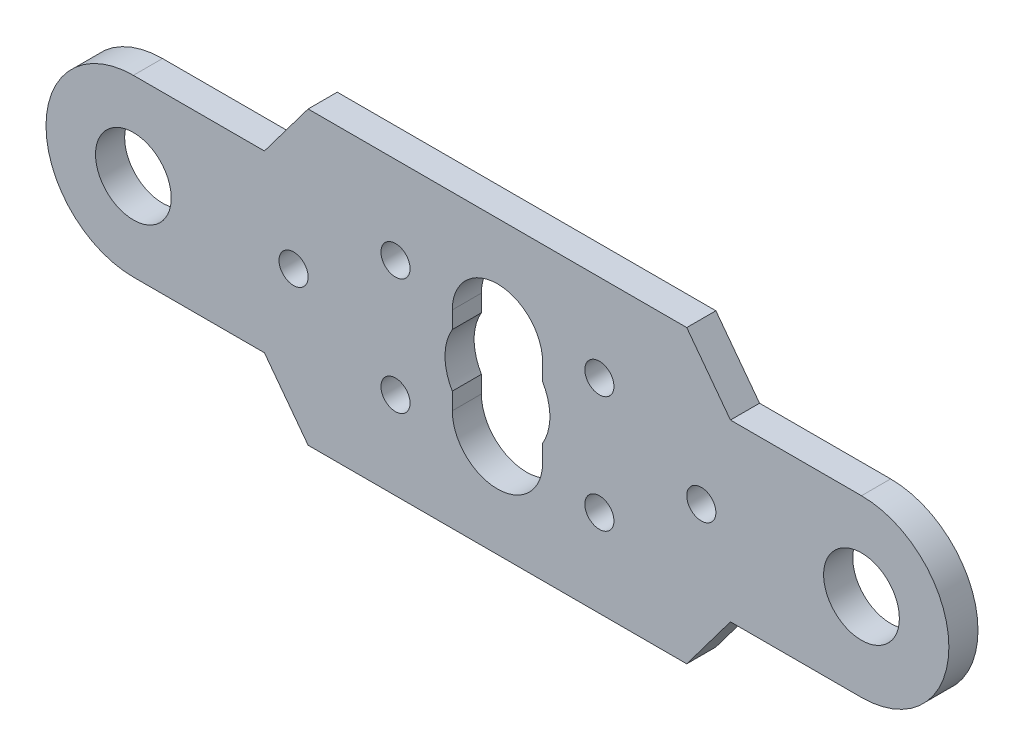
ISO-10303-21;
HEADER;
FILE_DESCRIPTION(('STEP AP214'),'2;1');
FILE_NAME('part.step','',(''),(''),'','','');
FILE_SCHEMA(('AUTOMOTIVE_DESIGN { 1 0 10303 214 1 1 1 1 }'));
ENDSEC;
DATA;
#1=APPLICATION_CONTEXT('core data for automotive mechanical design processes');
#2=APPLICATION_PROTOCOL_DEFINITION('international standard','automotive_design',2000,#1);
#3=PRODUCT_CONTEXT('',#1,'mechanical');
#4=PRODUCT('Part','Part','',(#3));
#5=PRODUCT_RELATED_PRODUCT_CATEGORY('part','',(#4));
#6=PRODUCT_DEFINITION_FORMATION('','',#4);
#7=PRODUCT_DEFINITION_CONTEXT('part definition',#1,'design');
#8=PRODUCT_DEFINITION('design','',#6,#7);
#9=PRODUCT_DEFINITION_SHAPE('','',#8);
#10=(LENGTH_UNIT() NAMED_UNIT(*) SI_UNIT(.MILLI.,.METRE.));
#11=(NAMED_UNIT(*) PLANE_ANGLE_UNIT() SI_UNIT($,.RADIAN.));
#12=(NAMED_UNIT(*) SI_UNIT($,.STERADIAN.) SOLID_ANGLE_UNIT());
#13=UNCERTAINTY_MEASURE_WITH_UNIT(LENGTH_MEASURE(1.E-05),#10,'distance_accuracy_value','');
#14=(GEOMETRIC_REPRESENTATION_CONTEXT(3) GLOBAL_UNCERTAINTY_ASSIGNED_CONTEXT((#13)) GLOBAL_UNIT_ASSIGNED_CONTEXT((#10,
#11,#12)) REPRESENTATION_CONTEXT('',''));
#15=CARTESIAN_POINT('',(0.,0.,0.));
#16=DIRECTION('',(0.,0.,1.));
#17=DIRECTION('',(1.,0.,0.));
#18=AXIS2_PLACEMENT_3D('',#15,#16,#17);
#19=CARTESIAN_POINT('',(12.5,0.,1.));
#20=DIRECTION('',(0.,0.,-1.));
#21=DIRECTION('',(-1.,0.,0.));
#22=AXIS2_PLACEMENT_3D('',#19,#20,#21);
#23=CYLINDRICAL_SURFACE('',#22,3.);
#24=CARTESIAN_POINT('',(12.5,0.,0.));
#25=DIRECTION('',(0.,0.,1.));
#26=DIRECTION('',(-1.,0.,0.));
#27=AXIS2_PLACEMENT_3D('',#24,#25,#26);
#28=CIRCLE('',#27,3.);
#29=CARTESIAN_POINT('',(12.5,-3.,0.));
#30=VERTEX_POINT('',#29);
#31=CARTESIAN_POINT('',(12.5,3.,0.));
#32=VERTEX_POINT('',#31);
#33=EDGE_CURVE('E364',#30,#32,#28,.T.);
#34=ORIENTED_EDGE('',*,*,#33,.T.);
#35=DIRECTION('',(0.,0.,-1.));
#36=VECTOR('',#35,1.);
#37=CARTESIAN_POINT('',(12.5,3.,1.));
#38=LINE('',#37,#36);
#39=CARTESIAN_POINT('',(12.5,3.,1.));
#40=VERTEX_POINT('',#39);
#41=EDGE_CURVE('E39',#40,#32,#38,.T.);
#42=ORIENTED_EDGE('',*,*,#41,.F.);
#43=CARTESIAN_POINT('',(12.5,0.,1.));
#44=DIRECTION('',(0.,0.,1.));
#45=DIRECTION('',(-1.,0.,0.));
#46=AXIS2_PLACEMENT_3D('',#43,#44,#45);
#47=CIRCLE('',#46,3.);
#48=CARTESIAN_POINT('',(12.5,-3.,1.));
#49=VERTEX_POINT('',#48);
#50=EDGE_CURVE('E77',#49,#40,#47,.T.);
#51=ORIENTED_EDGE('',*,*,#50,.F.);
#52=DIRECTION('',(0.,0.,-1.));
#53=VECTOR('',#52,1.);
#54=CARTESIAN_POINT('',(12.5,-3.,1.));
#55=LINE('',#54,#53);
#56=EDGE_CURVE('E329',#49,#30,#55,.T.);
#57=ORIENTED_EDGE('',*,*,#56,.T.);
#58=EDGE_LOOP('',(#34,#42,#51,#57));
#59=FACE_BOUND('',#58,.T.);
#60=ADVANCED_FACE('F32',(#59),#23,.T.);
#61=CARTESIAN_POINT('',(8.00000000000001,3.,1.));
#62=DIRECTION('',(0.,-1.,0.));
#63=DIRECTION('',(0.,0.,-1.));
#64=AXIS2_PLACEMENT_3D('',#61,#62,#63);
#65=PLANE('',#64);
#66=DIRECTION('',(-1.,0.,0.));
#67=VECTOR('',#66,1.);
#68=CARTESIAN_POINT('',(8.00000000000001,3.,0.));
#69=LINE('',#68,#67);
#70=CARTESIAN_POINT('',(8.00000000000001,3.,0.));
#71=VERTEX_POINT('',#70);
#72=EDGE_CURVE('E376',#32,#71,#69,.T.);
#73=ORIENTED_EDGE('',*,*,#72,.T.);
#74=DIRECTION('',(0.,0.,-1.));
#75=VECTOR('',#74,1.);
#76=CARTESIAN_POINT('',(8.00000000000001,3.,1.));
#77=LINE('',#76,#75);
#78=CARTESIAN_POINT('',(8.00000000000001,3.,1.));
#79=VERTEX_POINT('',#78);
#80=EDGE_CURVE('E381',#79,#71,#77,.T.);
#81=ORIENTED_EDGE('',*,*,#80,.F.);
#82=DIRECTION('',(-1.,0.,0.));
#83=VECTOR('',#82,1.);
#84=CARTESIAN_POINT('',(8.00000000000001,3.,1.));
#85=LINE('',#84,#83);
#86=EDGE_CURVE('E368',#40,#79,#85,.T.);
#87=ORIENTED_EDGE('',*,*,#86,.F.);
#88=ORIENTED_EDGE('',*,*,#41,.T.);
#89=EDGE_LOOP('',(#73,#81,#87,#88));
#90=FACE_BOUND('',#89,.T.);
#91=ADVANCED_FACE('F386',(#90),#65,.F.);
#92=CARTESIAN_POINT('',(6.5,5.,1.));
#93=DIRECTION('',(-0.799999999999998,-0.600000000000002,0.));
#94=DIRECTION('',(0.600000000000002,-0.799999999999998,0.));
#95=AXIS2_PLACEMENT_3D('',#92,#93,#94);
#96=PLANE('',#95);
#97=DIRECTION('',(-0.600000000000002,0.799999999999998,0.));
#98=VECTOR('',#97,1.);
#99=CARTESIAN_POINT('',(6.5,5.,0.));
#100=LINE('',#99,#98);
#101=CARTESIAN_POINT('',(6.5,5.,0.));
#102=VERTEX_POINT('',#101);
#103=EDGE_CURVE('E72',#71,#102,#100,.T.);
#104=ORIENTED_EDGE('',*,*,#103,.T.);
#105=DIRECTION('',(0.,0.,-1.));
#106=VECTOR('',#105,1.);
#107=CARTESIAN_POINT('',(6.5,5.,1.));
#108=LINE('',#107,#106);
#109=CARTESIAN_POINT('',(6.5,5.,1.));
#110=VERTEX_POINT('',#109);
#111=EDGE_CURVE('E374',#110,#102,#108,.T.);
#112=ORIENTED_EDGE('',*,*,#111,.F.);
#113=DIRECTION('',(-0.600000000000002,0.799999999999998,0.));
#114=VECTOR('',#113,1.);
#115=CARTESIAN_POINT('',(6.5,5.,1.));
#116=LINE('',#115,#114);
#117=EDGE_CURVE('E55',#79,#110,#116,.T.);
#118=ORIENTED_EDGE('',*,*,#117,.F.);
#119=ORIENTED_EDGE('',*,*,#80,.T.);
#120=EDGE_LOOP('',(#104,#112,#118,#119));
#121=FACE_BOUND('',#120,.T.);
#122=ADVANCED_FACE('F430',(#121),#96,.F.);
#123=CARTESIAN_POINT('',(0.,5.,1.));
#124=DIRECTION('',(0.,-1.,0.));
#125=DIRECTION('',(0.,0.,-1.));
#126=AXIS2_PLACEMENT_3D('',#123,#124,#125);
#127=PLANE('',#126);
#128=DIRECTION('',(-1.,0.,0.));
#129=VECTOR('',#128,1.);
#130=CARTESIAN_POINT('',(0.,5.,0.));
#131=LINE('',#130,#129);
#132=CARTESIAN_POINT('',(-6.5,5.,0.));
#133=VERTEX_POINT('',#132);
#134=EDGE_CURVE('E369',#102,#133,#131,.T.);
#135=ORIENTED_EDGE('',*,*,#134,.T.);
#136=DIRECTION('',(0.,0.,-1.));
#137=VECTOR('',#136,1.);
#138=CARTESIAN_POINT('',(-6.5,5.,1.));
#139=LINE('',#138,#137);
#140=CARTESIAN_POINT('',(-6.5,5.,1.));
#141=VERTEX_POINT('',#140);
#142=EDGE_CURVE('E272',#141,#133,#139,.T.);
#143=ORIENTED_EDGE('',*,*,#142,.F.);
#144=DIRECTION('',(-1.,0.,0.));
#145=VECTOR('',#144,1.);
#146=CARTESIAN_POINT('',(0.,5.,1.));
#147=LINE('',#146,#145);
#148=EDGE_CURVE('E372',#110,#141,#147,.T.);
#149=ORIENTED_EDGE('',*,*,#148,.F.);
#150=ORIENTED_EDGE('',*,*,#111,.T.);
#151=EDGE_LOOP('',(#135,#143,#149,#150));
#152=FACE_BOUND('',#151,.T.);
#153=ADVANCED_FACE('F395',(#152),#127,.F.);
#154=CARTESIAN_POINT('',(12.5,0.,1.));
#155=DIRECTION('',(0.,0.,-1.));
#156=DIRECTION('',(-1.,0.,0.));
#157=AXIS2_PLACEMENT_3D('',#154,#155,#156);
#158=PLANE('',#157);
#159=DIRECTION('',(0.,1.,0.));
#160=VECTOR('',#159,1.);
#161=CARTESIAN_POINT('',(-1.55,1.5,1.));
#162=LINE('',#161,#160);
#163=CARTESIAN_POINT('',(-1.55,0.915150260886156,1.));
#164=VERTEX_POINT('',#163);
#165=CARTESIAN_POINT('',(-1.55,1.5,1.));
#166=VERTEX_POINT('',#165);
#167=EDGE_CURVE('E241',#164,#166,#162,.T.);
#168=ORIENTED_EDGE('',*,*,#167,.T.);
#169=CARTESIAN_POINT('',(0.,1.5,1.));
#170=DIRECTION('',(0.,0.,1.));
#171=DIRECTION('',(1.,0.,0.));
#172=AXIS2_PLACEMENT_3D('',#169,#170,#171);
#173=CIRCLE('',#172,1.55);
#174=CARTESIAN_POINT('',(1.55,1.5,1.));
#175=VERTEX_POINT('',#174);
#176=EDGE_CURVE('E342',#175,#166,#173,.T.);
#177=ORIENTED_EDGE('',*,*,#176,.F.);
#178=DIRECTION('',(0.,1.,0.));
#179=VECTOR('',#178,1.);
#180=CARTESIAN_POINT('',(1.55,1.5,1.));
#181=LINE('',#180,#179);
#182=CARTESIAN_POINT('',(1.55,0.915150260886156,1.));
#183=VERTEX_POINT('',#182);
#184=EDGE_CURVE('E346',#183,#175,#181,.T.);
#185=ORIENTED_EDGE('',*,*,#184,.F.);
#186=CARTESIAN_POINT('',(0.,0.,1.));
#187=DIRECTION('',(0.,0.,1.));
#188=DIRECTION('',(1.,0.,0.));
#189=AXIS2_PLACEMENT_3D('',#186,#187,#188);
#190=CIRCLE('',#189,1.8);
#191=CARTESIAN_POINT('',(1.55,-0.915150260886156,1.));
#192=VERTEX_POINT('',#191);
#193=EDGE_CURVE('E336',#192,#183,#190,.T.);
#194=ORIENTED_EDGE('',*,*,#193,.F.);
#195=DIRECTION('',(0.,-1.,0.));
#196=VECTOR('',#195,1.);
#197=CARTESIAN_POINT('',(1.55,-1.5,1.));
#198=LINE('',#197,#196);
#199=CARTESIAN_POINT('',(1.55,-1.5,1.));
#200=VERTEX_POINT('',#199);
#201=EDGE_CURVE('E196',#192,#200,#198,.T.);
#202=ORIENTED_EDGE('',*,*,#201,.T.);
#203=CARTESIAN_POINT('',(0.,-1.5,1.));
#204=DIRECTION('',(0.,0.,-1.));
#205=DIRECTION('',(1.,0.,0.));
#206=AXIS2_PLACEMENT_3D('',#203,#204,#205);
#207=CIRCLE('',#206,1.55);
#208=CARTESIAN_POINT('',(-1.55,-1.5,1.));
#209=VERTEX_POINT('',#208);
#210=EDGE_CURVE('E291',#200,#209,#207,.T.);
#211=ORIENTED_EDGE('',*,*,#210,.T.);
#212=DIRECTION('',(0.,-1.,0.));
#213=VECTOR('',#212,1.);
#214=CARTESIAN_POINT('',(-1.55,-1.5,1.));
#215=LINE('',#214,#213);
#216=CARTESIAN_POINT('',(-1.55,-0.915150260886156,1.));
#217=VERTEX_POINT('',#216);
#218=EDGE_CURVE('E202',#217,#209,#215,.T.);
#219=ORIENTED_EDGE('',*,*,#218,.F.);
#220=CARTESIAN_POINT('',(0.,0.,1.));
#221=DIRECTION('',(0.,0.,-1.));
#222=DIRECTION('',(-1.,0.,0.));
#223=AXIS2_PLACEMENT_3D('',#220,#221,#222);
#224=CIRCLE('',#223,1.8);
#225=EDGE_CURVE('E181',#217,#164,#224,.T.);
#226=ORIENTED_EDGE('',*,*,#225,.T.);
#227=EDGE_LOOP('',(#168,#177,#185,#194,#202,#211,#219,#226));
#228=FACE_BOUND('',#227,.T.);
#229=CARTESIAN_POINT('',(7.,0.,1.));
#230=DIRECTION('',(0.,0.,1.));
#231=DIRECTION('',(1.,0.,0.));
#232=AXIS2_PLACEMENT_3D('',#229,#230,#231);
#233=CIRCLE('',#232,0.5);
#234=CARTESIAN_POINT('',(7.5,0.,1.));
#235=VERTEX_POINT('',#234);
#236=EDGE_CURVE('E332',#235,#235,#233,.T.);
#237=ORIENTED_EDGE('',*,*,#236,.F.);
#238=EDGE_LOOP('',(#237));
#239=FACE_BOUND('',#238,.T.);
#240=CARTESIAN_POINT('',(12.5,0.,1.));
#241=DIRECTION('',(0.,0.,1.));
#242=DIRECTION('',(1.,0.,0.));
#243=AXIS2_PLACEMENT_3D('',#240,#241,#242);
#244=CIRCLE('',#243,1.3);
#245=CARTESIAN_POINT('',(13.8,0.,1.));
#246=VERTEX_POINT('',#245);
#247=EDGE_CURVE('E358',#246,#246,#244,.T.);
#248=ORIENTED_EDGE('',*,*,#247,.F.);
#249=EDGE_LOOP('',(#248));
#250=FACE_BOUND('',#249,.T.);
#251=CARTESIAN_POINT('',(3.5,2.,1.));
#252=DIRECTION('',(0.,0.,1.));
#253=DIRECTION('',(1.,0.,0.));
#254=AXIS2_PLACEMENT_3D('',#251,#252,#253);
#255=CIRCLE('',#254,0.5);
#256=CARTESIAN_POINT('',(4.,2.,1.));
#257=VERTEX_POINT('',#256);
#258=EDGE_CURVE('E352',#257,#257,#255,.T.);
#259=ORIENTED_EDGE('',*,*,#258,.F.);
#260=EDGE_LOOP('',(#259));
#261=FACE_BOUND('',#260,.T.);
#262=ORIENTED_EDGE('',*,*,#148,.T.);
#263=DIRECTION('',(0.600000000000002,0.799999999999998,0.));
#264=VECTOR('',#263,1.);
#265=CARTESIAN_POINT('',(-6.5,5.,1.));
#266=LINE('',#265,#264);
#267=CARTESIAN_POINT('',(-8.00000000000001,3.,1.));
#268=VERTEX_POINT('',#267);
#269=EDGE_CURVE('E269',#268,#141,#266,.T.);
#270=ORIENTED_EDGE('',*,*,#269,.F.);
#271=DIRECTION('',(1.,0.,0.));
#272=VECTOR('',#271,1.);
#273=CARTESIAN_POINT('',(-8.00000000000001,3.,1.));
#274=LINE('',#273,#272);
#275=CARTESIAN_POINT('',(-12.5,3.,1.));
#276=VERTEX_POINT('',#275);
#277=EDGE_CURVE('E265',#276,#268,#274,.T.);
#278=ORIENTED_EDGE('',*,*,#277,.F.);
#279=CARTESIAN_POINT('',(-12.5,0.,1.));
#280=DIRECTION('',(0.,0.,-1.));
#281=DIRECTION('',(1.,0.,0.));
#282=AXIS2_PLACEMENT_3D('',#279,#280,#281);
#283=CIRCLE('',#282,3.);
#284=CARTESIAN_POINT('',(-12.5,-3.,1.));
#285=VERTEX_POINT('',#284);
#286=EDGE_CURVE('E262',#285,#276,#283,.T.);
#287=ORIENTED_EDGE('',*,*,#286,.F.);
#288=DIRECTION('',(1.,0.,0.));
#289=VECTOR('',#288,1.);
#290=CARTESIAN_POINT('',(-8.00000000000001,-3.,1.));
#291=LINE('',#290,#289);
#292=CARTESIAN_POINT('',(-8.00000000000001,-3.,1.));
#293=VERTEX_POINT('',#292);
#294=EDGE_CURVE('E214',#285,#293,#291,.T.);
#295=ORIENTED_EDGE('',*,*,#294,.T.);
#296=DIRECTION('',(0.600000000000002,-0.799999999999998,0.));
#297=VECTOR('',#296,1.);
#298=CARTESIAN_POINT('',(-6.5,-5.,1.));
#299=LINE('',#298,#297);
#300=CARTESIAN_POINT('',(-6.5,-5.,1.));
#301=VERTEX_POINT('',#300);
#302=EDGE_CURVE('E217',#293,#301,#299,.T.);
#303=ORIENTED_EDGE('',*,*,#302,.T.);
#304=DIRECTION('',(-1.,0.,0.));
#305=VECTOR('',#304,1.);
#306=CARTESIAN_POINT('',(0.,-5.,1.));
#307=LINE('',#306,#305);
#308=CARTESIAN_POINT('',(6.5,-5.,1.));
#309=VERTEX_POINT('',#308);
#310=EDGE_CURVE('E315',#309,#301,#307,.T.);
#311=ORIENTED_EDGE('',*,*,#310,.F.);
#312=DIRECTION('',(-0.600000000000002,-0.799999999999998,0.));
#313=VECTOR('',#312,1.);
#314=CARTESIAN_POINT('',(6.5,-5.,1.));
#315=LINE('',#314,#313);
#316=CARTESIAN_POINT('',(8.00000000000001,-3.,1.));
#317=VERTEX_POINT('',#316);
#318=EDGE_CURVE('E311',#317,#309,#315,.T.);
#319=ORIENTED_EDGE('',*,*,#318,.F.);
#320=DIRECTION('',(-1.,0.,0.));
#321=VECTOR('',#320,1.);
#322=CARTESIAN_POINT('',(8.00000000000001,-3.,1.));
#323=LINE('',#322,#321);
#324=EDGE_CURVE('E308',#49,#317,#323,.T.);
#325=ORIENTED_EDGE('',*,*,#324,.F.);
#326=ORIENTED_EDGE('',*,*,#50,.T.);
#327=ORIENTED_EDGE('',*,*,#86,.T.);
#328=ORIENTED_EDGE('',*,*,#117,.T.);
#329=EDGE_LOOP('',(#262,#270,#278,#287,#295,#303,#311,#319,#325,#326,#327,#328));
#330=FACE_BOUND('',#329,.T.);
#331=CARTESIAN_POINT('',(3.5,-2.,1.));
#332=DIRECTION('',(0.,0.,-1.));
#333=DIRECTION('',(1.,0.,0.));
#334=AXIS2_PLACEMENT_3D('',#331,#332,#333);
#335=CIRCLE('',#334,0.5);
#336=CARTESIAN_POINT('',(4.,-2.,1.));
#337=VERTEX_POINT('',#336);
#338=EDGE_CURVE('E299',#337,#337,#335,.T.);
#339=ORIENTED_EDGE('',*,*,#338,.T.);
#340=EDGE_LOOP('',(#339));
#341=FACE_BOUND('',#340,.T.);
#342=CARTESIAN_POINT('',(-7.,0.,1.));
#343=DIRECTION('',(0.,0.,-1.));
#344=DIRECTION('',(-1.,0.,0.));
#345=AXIS2_PLACEMENT_3D('',#342,#343,#344);
#346=CIRCLE('',#345,0.5);
#347=CARTESIAN_POINT('',(-7.5,0.,1.));
#348=VERTEX_POINT('',#347);
#349=EDGE_CURVE('E233',#348,#348,#346,.T.);
#350=ORIENTED_EDGE('',*,*,#349,.T.);
#351=EDGE_LOOP('',(#350));
#352=FACE_BOUND('',#351,.T.);
#353=CARTESIAN_POINT('',(-12.5,0.,1.));
#354=DIRECTION('',(0.,0.,-1.));
#355=DIRECTION('',(-1.,0.,0.));
#356=AXIS2_PLACEMENT_3D('',#353,#354,#355);
#357=CIRCLE('',#356,1.3);
#358=CARTESIAN_POINT('',(-13.8,0.,1.));
#359=VERTEX_POINT('',#358);
#360=EDGE_CURVE('E253',#359,#359,#357,.T.);
#361=ORIENTED_EDGE('',*,*,#360,.T.);
#362=EDGE_LOOP('',(#361));
#363=FACE_BOUND('',#362,.T.);
#364=CARTESIAN_POINT('',(-3.5,2.,1.));
#365=DIRECTION('',(0.,0.,-1.));
#366=DIRECTION('',(-1.,0.,0.));
#367=AXIS2_PLACEMENT_3D('',#364,#365,#366);
#368=CIRCLE('',#367,0.5);
#369=CARTESIAN_POINT('',(-4.,2.,1.));
#370=VERTEX_POINT('',#369);
#371=EDGE_CURVE('E248',#370,#370,#368,.T.);
#372=ORIENTED_EDGE('',*,*,#371,.T.);
#373=EDGE_LOOP('',(#372));
#374=FACE_BOUND('',#373,.T.);
#375=CARTESIAN_POINT('',(-3.5,-2.,1.));
#376=DIRECTION('',(0.,0.,1.));
#377=DIRECTION('',(-1.,0.,0.));
#378=AXIS2_PLACEMENT_3D('',#375,#376,#377);
#379=CIRCLE('',#378,0.5);
#380=CARTESIAN_POINT('',(-4.,-2.,1.));
#381=VERTEX_POINT('',#380);
#382=EDGE_CURVE('E206',#381,#381,#379,.T.);
#383=ORIENTED_EDGE('',*,*,#382,.F.);
#384=EDGE_LOOP('',(#383));
#385=FACE_BOUND('',#384,.T.);
#386=ADVANCED_FACE('F400',(#228,#239,#250,#261,#330,#341,#352,#363,#374,#385),#158,.F.);
#387=CARTESIAN_POINT('',(12.5,0.,0.));
#388=DIRECTION('',(0.,0.,-1.));
#389=DIRECTION('',(-1.,0.,0.));
#390=AXIS2_PLACEMENT_3D('',#387,#388,#389);
#391=PLANE('',#390);
#392=CARTESIAN_POINT('',(0.,1.5,0.));
#393=DIRECTION('',(0.,0.,1.));
#394=DIRECTION('',(1.,0.,0.));
#395=AXIS2_PLACEMENT_3D('',#392,#393,#394);
#396=CIRCLE('',#395,1.55);
#397=CARTESIAN_POINT('',(1.55,1.5,0.));
#398=VERTEX_POINT('',#397);
#399=CARTESIAN_POINT('',(-1.55,1.5,0.));
#400=VERTEX_POINT('',#399);
#401=EDGE_CURVE('E46',#398,#400,#396,.T.);
#402=ORIENTED_EDGE('',*,*,#401,.T.);
#403=DIRECTION('',(0.,1.,0.));
#404=VECTOR('',#403,1.);
#405=CARTESIAN_POINT('',(-1.55,1.5,0.));
#406=LINE('',#405,#404);
#407=CARTESIAN_POINT('',(-1.55,0.915150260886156,0.));
#408=VERTEX_POINT('',#407);
#409=EDGE_CURVE('E195',#408,#400,#406,.T.);
#410=ORIENTED_EDGE('',*,*,#409,.F.);
#411=CARTESIAN_POINT('',(0.,0.,0.));
#412=DIRECTION('',(0.,0.,1.));
#413=DIRECTION('',(1.,0.,0.));
#414=AXIS2_PLACEMENT_3D('',#411,#412,#413);
#415=CIRCLE('',#414,1.8);
#416=CARTESIAN_POINT('',(-1.55,-0.915150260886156,0.));
#417=VERTEX_POINT('',#416);
#418=EDGE_CURVE('E178',#408,#417,#415,.T.);
#419=ORIENTED_EDGE('',*,*,#418,.T.);
#420=DIRECTION('',(0.,-1.,0.));
#421=VECTOR('',#420,1.);
#422=CARTESIAN_POINT('',(-1.55,-1.5,0.));
#423=LINE('',#422,#421);
#424=CARTESIAN_POINT('',(-1.55,-1.5,0.));
#425=VERTEX_POINT('',#424);
#426=EDGE_CURVE('E187',#417,#425,#423,.T.);
#427=ORIENTED_EDGE('',*,*,#426,.T.);
#428=CARTESIAN_POINT('',(0.,-1.5,0.));
#429=DIRECTION('',(0.,0.,-1.));
#430=DIRECTION('',(1.,0.,0.));
#431=AXIS2_PLACEMENT_3D('',#428,#429,#430);
#432=CIRCLE('',#431,1.55);
#433=CARTESIAN_POINT('',(1.55,-1.5,0.));
#434=VERTEX_POINT('',#433);
#435=EDGE_CURVE('E290',#434,#425,#432,.T.);
#436=ORIENTED_EDGE('',*,*,#435,.F.);
#437=DIRECTION('',(0.,-1.,0.));
#438=VECTOR('',#437,1.);
#439=CARTESIAN_POINT('',(1.55,-1.5,0.));
#440=LINE('',#439,#438);
#441=CARTESIAN_POINT('',(1.55,-0.915150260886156,0.));
#442=VERTEX_POINT('',#441);
#443=EDGE_CURVE('E287',#442,#434,#440,.T.);
#444=ORIENTED_EDGE('',*,*,#443,.F.);
#445=CARTESIAN_POINT('',(0.,0.,0.));
#446=DIRECTION('',(0.,0.,-1.));
#447=DIRECTION('',(-1.,0.,0.));
#448=AXIS2_PLACEMENT_3D('',#445,#446,#447);
#449=CIRCLE('',#448,1.8);
#450=CARTESIAN_POINT('',(1.55,0.915150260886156,0.));
#451=VERTEX_POINT('',#450);
#452=EDGE_CURVE('E11',#451,#442,#449,.T.);
#453=ORIENTED_EDGE('',*,*,#452,.F.);
#454=DIRECTION('',(0.,1.,0.));
#455=VECTOR('',#454,1.);
#456=CARTESIAN_POINT('',(1.55,1.5,0.));
#457=LINE('',#456,#455);
#458=EDGE_CURVE('E339',#451,#398,#457,.T.);
#459=ORIENTED_EDGE('',*,*,#458,.T.);
#460=EDGE_LOOP('',(#402,#410,#419,#427,#436,#444,#453,#459));
#461=FACE_BOUND('',#460,.T.);
#462=CARTESIAN_POINT('',(7.,0.,0.));
#463=DIRECTION('',(0.,0.,1.));
#464=DIRECTION('',(1.,0.,0.));
#465=AXIS2_PLACEMENT_3D('',#462,#463,#464);
#466=CIRCLE('',#465,0.5);
#467=CARTESIAN_POINT('',(7.5,0.,0.));
#468=VERTEX_POINT('',#467);
#469=EDGE_CURVE('E333',#468,#468,#466,.T.);
#470=ORIENTED_EDGE('',*,*,#469,.T.);
#471=EDGE_LOOP('',(#470));
#472=FACE_BOUND('',#471,.T.);
#473=CARTESIAN_POINT('',(12.5,0.,0.));
#474=DIRECTION('',(0.,0.,1.));
#475=DIRECTION('',(1.,0.,0.));
#476=AXIS2_PLACEMENT_3D('',#473,#474,#475);
#477=CIRCLE('',#476,1.3);
#478=CARTESIAN_POINT('',(13.8,0.,0.));
#479=VERTEX_POINT('',#478);
#480=EDGE_CURVE('E361',#479,#479,#477,.T.);
#481=ORIENTED_EDGE('',*,*,#480,.T.);
#482=EDGE_LOOP('',(#481));
#483=FACE_BOUND('',#482,.T.);
#484=DIRECTION('',(0.600000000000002,0.799999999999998,0.));
#485=VECTOR('',#484,1.);
#486=CARTESIAN_POINT('',(-6.5,5.,0.));
#487=LINE('',#486,#485);
#488=CARTESIAN_POINT('',(-8.00000000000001,3.,0.));
#489=VERTEX_POINT('',#488);
#490=EDGE_CURVE('E266',#489,#133,#487,.T.);
#491=ORIENTED_EDGE('',*,*,#490,.T.);
#492=ORIENTED_EDGE('',*,*,#134,.F.);
#493=ORIENTED_EDGE('',*,*,#103,.F.);
#494=ORIENTED_EDGE('',*,*,#72,.F.);
#495=ORIENTED_EDGE('',*,*,#33,.F.);
#496=DIRECTION('',(-1.,0.,0.));
#497=VECTOR('',#496,1.);
#498=CARTESIAN_POINT('',(8.00000000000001,-3.,0.));
#499=LINE('',#498,#497);
#500=CARTESIAN_POINT('',(8.00000000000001,-3.,0.));
#501=VERTEX_POINT('',#500);
#502=EDGE_CURVE('E305',#30,#501,#499,.T.);
#503=ORIENTED_EDGE('',*,*,#502,.T.);
#504=DIRECTION('',(-0.600000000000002,-0.799999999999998,0.));
#505=VECTOR('',#504,1.);
#506=CARTESIAN_POINT('',(6.5,-5.,0.));
#507=LINE('',#506,#505);
#508=CARTESIAN_POINT('',(6.5,-5.,0.));
#509=VERTEX_POINT('',#508);
#510=EDGE_CURVE('E320',#501,#509,#507,.T.);
#511=ORIENTED_EDGE('',*,*,#510,.T.);
#512=DIRECTION('',(-1.,0.,0.));
#513=VECTOR('',#512,1.);
#514=CARTESIAN_POINT('',(0.,-5.,0.));
#515=LINE('',#514,#513);
#516=CARTESIAN_POINT('',(-6.5,-5.,0.));
#517=VERTEX_POINT('',#516);
#518=EDGE_CURVE('E312',#509,#517,#515,.T.);
#519=ORIENTED_EDGE('',*,*,#518,.T.);
#520=DIRECTION('',(0.600000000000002,-0.799999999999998,0.));
#521=VECTOR('',#520,1.);
#522=CARTESIAN_POINT('',(-6.5,-5.,0.));
#523=LINE('',#522,#521);
#524=CARTESIAN_POINT('',(-8.00000000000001,-3.,0.));
#525=VERTEX_POINT('',#524);
#526=EDGE_CURVE('E218',#525,#517,#523,.T.);
#527=ORIENTED_EDGE('',*,*,#526,.F.);
#528=DIRECTION('',(1.,0.,0.));
#529=VECTOR('',#528,1.);
#530=CARTESIAN_POINT('',(-8.00000000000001,-3.,0.));
#531=LINE('',#530,#529);
#532=CARTESIAN_POINT('',(-12.5,-3.,0.));
#533=VERTEX_POINT('',#532);
#534=EDGE_CURVE('E211',#533,#525,#531,.T.);
#535=ORIENTED_EDGE('',*,*,#534,.F.);
#536=CARTESIAN_POINT('',(-12.5,0.,0.));
#537=DIRECTION('',(0.,0.,-1.));
#538=DIRECTION('',(1.,0.,0.));
#539=AXIS2_PLACEMENT_3D('',#536,#537,#538);
#540=CIRCLE('',#539,3.);
#541=CARTESIAN_POINT('',(-12.5,3.,0.));
#542=VERTEX_POINT('',#541);
#543=EDGE_CURVE('E259',#533,#542,#540,.T.);
#544=ORIENTED_EDGE('',*,*,#543,.T.);
#545=DIRECTION('',(1.,0.,0.));
#546=VECTOR('',#545,1.);
#547=CARTESIAN_POINT('',(-8.00000000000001,3.,0.));
#548=LINE('',#547,#546);
#549=EDGE_CURVE('E275',#542,#489,#548,.T.);
#550=ORIENTED_EDGE('',*,*,#549,.T.);
#551=EDGE_LOOP('',(#491,#492,#493,#494,#495,#503,#511,#519,#527,#535,#544,#550));
#552=FACE_BOUND('',#551,.T.);
#553=CARTESIAN_POINT('',(3.5,2.,0.));
#554=DIRECTION('',(0.,0.,1.));
#555=DIRECTION('',(1.,0.,0.));
#556=AXIS2_PLACEMENT_3D('',#553,#554,#555);
#557=CIRCLE('',#556,0.5);
#558=CARTESIAN_POINT('',(4.,2.,0.));
#559=VERTEX_POINT('',#558);
#560=EDGE_CURVE('E355',#559,#559,#557,.T.);
#561=ORIENTED_EDGE('',*,*,#560,.T.);
#562=EDGE_LOOP('',(#561));
#563=FACE_BOUND('',#562,.T.);
#564=CARTESIAN_POINT('',(3.5,-2.,0.));
#565=DIRECTION('',(0.,0.,-1.));
#566=DIRECTION('',(1.,0.,0.));
#567=AXIS2_PLACEMENT_3D('',#564,#565,#566);
#568=CIRCLE('',#567,0.5);
#569=CARTESIAN_POINT('',(4.,-2.,0.));
#570=VERTEX_POINT('',#569);
#571=EDGE_CURVE('E302',#570,#570,#568,.T.);
#572=ORIENTED_EDGE('',*,*,#571,.F.);
#573=EDGE_LOOP('',(#572));
#574=FACE_BOUND('',#573,.T.);
#575=CARTESIAN_POINT('',(-7.,0.,0.));
#576=DIRECTION('',(0.,0.,-1.));
#577=DIRECTION('',(-1.,0.,0.));
#578=AXIS2_PLACEMENT_3D('',#575,#576,#577);
#579=CIRCLE('',#578,0.5);
#580=CARTESIAN_POINT('',(-7.5,0.,0.));
#581=VERTEX_POINT('',#580);
#582=EDGE_CURVE('E234',#581,#581,#579,.T.);
#583=ORIENTED_EDGE('',*,*,#582,.F.);
#584=EDGE_LOOP('',(#583));
#585=FACE_BOUND('',#584,.T.);
#586=CARTESIAN_POINT('',(-12.5,0.,0.));
#587=DIRECTION('',(0.,0.,-1.));
#588=DIRECTION('',(-1.,0.,0.));
#589=AXIS2_PLACEMENT_3D('',#586,#587,#588);
#590=CIRCLE('',#589,1.3);
#591=CARTESIAN_POINT('',(-13.8,0.,0.));
#592=VERTEX_POINT('',#591);
#593=EDGE_CURVE('E256',#592,#592,#590,.T.);
#594=ORIENTED_EDGE('',*,*,#593,.F.);
#595=EDGE_LOOP('',(#594));
#596=FACE_BOUND('',#595,.T.);
#597=CARTESIAN_POINT('',(-3.5,2.,0.));
#598=DIRECTION('',(0.,0.,-1.));
#599=DIRECTION('',(-1.,0.,0.));
#600=AXIS2_PLACEMENT_3D('',#597,#598,#599);
#601=CIRCLE('',#600,0.5);
#602=CARTESIAN_POINT('',(-4.,2.,0.));
#603=VERTEX_POINT('',#602);
#604=EDGE_CURVE('E250',#603,#603,#601,.T.);
#605=ORIENTED_EDGE('',*,*,#604,.F.);
#606=EDGE_LOOP('',(#605));
#607=FACE_BOUND('',#606,.T.);
#608=CARTESIAN_POINT('',(-3.5,-2.,0.));
#609=DIRECTION('',(0.,0.,1.));
#610=DIRECTION('',(-1.,0.,0.));
#611=AXIS2_PLACEMENT_3D('',#608,#609,#610);
#612=CIRCLE('',#611,0.5);
#613=CARTESIAN_POINT('',(-4.,-2.,0.));
#614=VERTEX_POINT('',#613);
#615=EDGE_CURVE('E208',#614,#614,#612,.T.);
#616=ORIENTED_EDGE('',*,*,#615,.T.);
#617=EDGE_LOOP('',(#616));
#618=FACE_BOUND('',#617,.T.);
#619=ADVANCED_FACE('F191',(#461,#472,#483,#552,#563,#574,#585,#596,#607,#618),#391,.T.);
#620=CARTESIAN_POINT('',(12.5,0.,0.));
#621=DIRECTION('',(0.,0.,1.));
#622=DIRECTION('',(1.,0.,0.));
#623=AXIS2_PLACEMENT_3D('',#620,#621,#622);
#624=CYLINDRICAL_SURFACE('',#623,1.3);
#625=ORIENTED_EDGE('',*,*,#247,.T.);
#626=EDGE_LOOP('',(#625));
#627=FACE_BOUND('',#626,.T.);
#628=ORIENTED_EDGE('',*,*,#480,.F.);
#629=EDGE_LOOP('',(#628));
#630=FACE_BOUND('',#629,.T.);
#631=ADVANCED_FACE('F440',(#627,#630),#624,.F.);
#632=CARTESIAN_POINT('',(3.5,2.,0.));
#633=DIRECTION('',(0.,0.,1.));
#634=DIRECTION('',(1.,0.,0.));
#635=AXIS2_PLACEMENT_3D('',#632,#633,#634);
#636=CYLINDRICAL_SURFACE('',#635,0.5);
#637=ORIENTED_EDGE('',*,*,#560,.F.);
#638=EDGE_LOOP('',(#637));
#639=FACE_BOUND('',#638,.T.);
#640=ORIENTED_EDGE('',*,*,#258,.T.);
#641=EDGE_LOOP('',(#640));
#642=FACE_BOUND('',#641,.T.);
#643=ADVANCED_FACE('F446',(#639,#642),#636,.F.);
#644=CARTESIAN_POINT('',(0.,0.,0.));
#645=DIRECTION('',(0.,0.,1.));
#646=DIRECTION('',(1.,0.,0.));
#647=AXIS2_PLACEMENT_3D('',#644,#645,#646);
#648=CYLINDRICAL_SURFACE('',#647,1.8);
#649=ORIENTED_EDGE('',*,*,#193,.T.);
#650=DIRECTION('',(0.,0.,1.));
#651=VECTOR('',#650,1.);
#652=CARTESIAN_POINT('',(1.55,0.915150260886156,0.));
#653=LINE('',#652,#651);
#654=EDGE_CURVE('E344',#451,#183,#653,.T.);
#655=ORIENTED_EDGE('',*,*,#654,.F.);
#656=ORIENTED_EDGE('',*,*,#452,.T.);
#657=DIRECTION('',(0.,0.,1.));
#658=VECTOR('',#657,1.);
#659=CARTESIAN_POINT('',(1.55,-0.915150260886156,0.));
#660=LINE('',#659,#658);
#661=EDGE_CURVE('E293',#442,#192,#660,.T.);
#662=ORIENTED_EDGE('',*,*,#661,.T.);
#663=EDGE_LOOP('',(#649,#655,#656,#662));
#664=FACE_BOUND('',#663,.T.);
#665=ADVANCED_FACE('F450',(#664),#648,.F.);
#666=CARTESIAN_POINT('',(0.,1.5,0.));
#667=DIRECTION('',(0.,0.,1.));
#668=DIRECTION('',(1.,0.,0.));
#669=AXIS2_PLACEMENT_3D('',#666,#667,#668);
#670=CYLINDRICAL_SURFACE('',#669,1.55);
#671=ORIENTED_EDGE('',*,*,#401,.F.);
#672=DIRECTION('',(0.,0.,1.));
#673=VECTOR('',#672,1.);
#674=CARTESIAN_POINT('',(1.55,1.5,0.));
#675=LINE('',#674,#673);
#676=EDGE_CURVE('E350',#398,#175,#675,.T.);
#677=ORIENTED_EDGE('',*,*,#676,.T.);
#678=ORIENTED_EDGE('',*,*,#176,.T.);
#679=DIRECTION('',(0.,0.,1.));
#680=VECTOR('',#679,1.);
#681=CARTESIAN_POINT('',(-1.55,1.5,0.));
#682=LINE('',#681,#680);
#683=EDGE_CURVE('E245',#400,#166,#682,.T.);
#684=ORIENTED_EDGE('',*,*,#683,.F.);
#685=EDGE_LOOP('',(#671,#677,#678,#684));
#686=FACE_BOUND('',#685,.T.);
#687=ADVANCED_FACE('F454',(#686),#670,.F.);
#688=CARTESIAN_POINT('',(1.55,1.5,0.));
#689=DIRECTION('',(1.,0.,0.));
#690=DIRECTION('',(0.,1.,0.));
#691=AXIS2_PLACEMENT_3D('',#688,#689,#690);
#692=PLANE('',#691);
#693=ORIENTED_EDGE('',*,*,#184,.T.);
#694=ORIENTED_EDGE('',*,*,#676,.F.);
#695=ORIENTED_EDGE('',*,*,#458,.F.);
#696=ORIENTED_EDGE('',*,*,#654,.T.);
#697=EDGE_LOOP('',(#693,#694,#695,#696));
#698=FACE_BOUND('',#697,.T.);
#699=ADVANCED_FACE('F456',(#698),#692,.F.);
#700=CARTESIAN_POINT('',(7.,0.,0.));
#701=DIRECTION('',(0.,0.,1.));
#702=DIRECTION('',(1.,0.,0.));
#703=AXIS2_PLACEMENT_3D('',#700,#701,#702);
#704=CYLINDRICAL_SURFACE('',#703,0.5);
#705=ORIENTED_EDGE('',*,*,#236,.T.);
#706=EDGE_LOOP('',(#705));
#707=FACE_BOUND('',#706,.T.);
#708=ORIENTED_EDGE('',*,*,#469,.F.);
#709=EDGE_LOOP('',(#708));
#710=FACE_BOUND('',#709,.T.);
#711=ADVANCED_FACE('F459',(#707,#710),#704,.F.);
#712=CARTESIAN_POINT('',(8.00000000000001,-3.,1.));
#713=DIRECTION('',(0.,1.,0.));
#714=DIRECTION('',(0.,0.,-1.));
#715=AXIS2_PLACEMENT_3D('',#712,#713,#714);
#716=PLANE('',#715);
#717=ORIENTED_EDGE('',*,*,#502,.F.);
#718=ORIENTED_EDGE('',*,*,#56,.F.);
#719=ORIENTED_EDGE('',*,*,#324,.T.);
#720=DIRECTION('',(0.,0.,-1.));
#721=VECTOR('',#720,1.);
#722=CARTESIAN_POINT('',(8.00000000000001,-3.,1.));
#723=LINE('',#722,#721);
#724=EDGE_CURVE('E326',#317,#501,#723,.T.);
#725=ORIENTED_EDGE('',*,*,#724,.T.);
#726=EDGE_LOOP('',(#717,#718,#719,#725));
#727=FACE_BOUND('',#726,.T.);
#728=ADVANCED_FACE('F425',(#727),#716,.F.);
#729=CARTESIAN_POINT('',(6.5,-5.,1.));
#730=DIRECTION('',(-0.799999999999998,0.600000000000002,0.));
#731=DIRECTION('',(0.600000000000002,0.799999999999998,0.));
#732=AXIS2_PLACEMENT_3D('',#729,#730,#731);
#733=PLANE('',#732);
#734=ORIENTED_EDGE('',*,*,#510,.F.);
#735=ORIENTED_EDGE('',*,*,#724,.F.);
#736=ORIENTED_EDGE('',*,*,#318,.T.);
#737=DIRECTION('',(0.,0.,-1.));
#738=VECTOR('',#737,1.);
#739=CARTESIAN_POINT('',(6.5,-5.,1.));
#740=LINE('',#739,#738);
#741=EDGE_CURVE('E317',#309,#509,#740,.T.);
#742=ORIENTED_EDGE('',*,*,#741,.T.);
#743=EDGE_LOOP('',(#734,#735,#736,#742));
#744=FACE_BOUND('',#743,.T.);
#745=ADVANCED_FACE('F422',(#744),#733,.F.);
#746=CARTESIAN_POINT('',(0.,-5.,1.));
#747=DIRECTION('',(0.,1.,0.));
#748=DIRECTION('',(0.,0.,-1.));
#749=AXIS2_PLACEMENT_3D('',#746,#747,#748);
#750=PLANE('',#749);
#751=ORIENTED_EDGE('',*,*,#518,.F.);
#752=ORIENTED_EDGE('',*,*,#741,.F.);
#753=ORIENTED_EDGE('',*,*,#310,.T.);
#754=DIRECTION('',(0.,0.,-1.));
#755=VECTOR('',#754,1.);
#756=CARTESIAN_POINT('',(-6.5,-5.,1.));
#757=LINE('',#756,#755);
#758=EDGE_CURVE('E221',#301,#517,#757,.T.);
#759=ORIENTED_EDGE('',*,*,#758,.T.);
#760=EDGE_LOOP('',(#751,#752,#753,#759));
#761=FACE_BOUND('',#760,.T.);
#762=ADVANCED_FACE('F419',(#761),#750,.F.);
#763=CARTESIAN_POINT('',(3.5,-2.,0.));
#764=DIRECTION('',(0.,0.,1.));
#765=DIRECTION('',(1.,0.,0.));
#766=AXIS2_PLACEMENT_3D('',#763,#764,#765);
#767=CYLINDRICAL_SURFACE('',#766,0.5);
#768=ORIENTED_EDGE('',*,*,#571,.T.);
#769=EDGE_LOOP('',(#768));
#770=FACE_BOUND('',#769,.T.);
#771=ORIENTED_EDGE('',*,*,#338,.F.);
#772=EDGE_LOOP('',(#771));
#773=FACE_BOUND('',#772,.T.);
#774=ADVANCED_FACE('F472',(#770,#773),#767,.F.);
#775=CARTESIAN_POINT('',(0.,-1.5,0.));
#776=DIRECTION('',(0.,0.,1.));
#777=DIRECTION('',(1.,0.,0.));
#778=AXIS2_PLACEMENT_3D('',#775,#776,#777);
#779=CYLINDRICAL_SURFACE('',#778,1.55);
#780=ORIENTED_EDGE('',*,*,#435,.T.);
#781=DIRECTION('',(0.,0.,1.));
#782=VECTOR('',#781,1.);
#783=CARTESIAN_POINT('',(-1.55,-1.5,0.));
#784=LINE('',#783,#782);
#785=EDGE_CURVE('E186',#425,#209,#784,.T.);
#786=ORIENTED_EDGE('',*,*,#785,.T.);
#787=ORIENTED_EDGE('',*,*,#210,.F.);
#788=DIRECTION('',(0.,0.,1.));
#789=VECTOR('',#788,1.);
#790=CARTESIAN_POINT('',(1.55,-1.5,0.));
#791=LINE('',#790,#789);
#792=EDGE_CURVE('E297',#434,#200,#791,.T.);
#793=ORIENTED_EDGE('',*,*,#792,.F.);
#794=EDGE_LOOP('',(#780,#786,#787,#793));
#795=FACE_BOUND('',#794,.T.);
#796=ADVANCED_FACE('F475',(#795),#779,.F.);
#797=CARTESIAN_POINT('',(1.55,-1.5,0.));
#798=DIRECTION('',(1.,0.,0.));
#799=DIRECTION('',(0.,-1.,0.));
#800=AXIS2_PLACEMENT_3D('',#797,#798,#799);
#801=PLANE('',#800);
#802=ORIENTED_EDGE('',*,*,#201,.F.);
#803=ORIENTED_EDGE('',*,*,#661,.F.);
#804=ORIENTED_EDGE('',*,*,#443,.T.);
#805=ORIENTED_EDGE('',*,*,#792,.T.);
#806=EDGE_LOOP('',(#802,#803,#804,#805));
#807=FACE_BOUND('',#806,.T.);
#808=ADVANCED_FACE('F477',(#807),#801,.F.);
#809=CARTESIAN_POINT('',(-12.5,0.,1.));
#810=DIRECTION('',(0.,0.,-1.));
#811=DIRECTION('',(1.,0.,0.));
#812=AXIS2_PLACEMENT_3D('',#809,#810,#811);
#813=CYLINDRICAL_SURFACE('',#812,3.);
#814=ORIENTED_EDGE('',*,*,#543,.F.);
#815=DIRECTION('',(0.,0.,-1.));
#816=VECTOR('',#815,1.);
#817=CARTESIAN_POINT('',(-12.5,-3.,1.));
#818=LINE('',#817,#816);
#819=EDGE_CURVE('E230',#285,#533,#818,.T.);
#820=ORIENTED_EDGE('',*,*,#819,.F.);
#821=ORIENTED_EDGE('',*,*,#286,.T.);
#822=DIRECTION('',(0.,0.,-1.));
#823=VECTOR('',#822,1.);
#824=CARTESIAN_POINT('',(-12.5,3.,1.));
#825=LINE('',#824,#823);
#826=EDGE_CURVE('E197',#276,#542,#825,.T.);
#827=ORIENTED_EDGE('',*,*,#826,.T.);
#828=EDGE_LOOP('',(#814,#820,#821,#827));
#829=FACE_BOUND('',#828,.T.);
#830=ADVANCED_FACE('F409',(#829),#813,.T.);
#831=CARTESIAN_POINT('',(-8.00000000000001,3.,1.));
#832=DIRECTION('',(0.,-1.,0.));
#833=DIRECTION('',(0.,0.,-1.));
#834=AXIS2_PLACEMENT_3D('',#831,#832,#833);
#835=PLANE('',#834);
#836=ORIENTED_EDGE('',*,*,#549,.F.);
#837=ORIENTED_EDGE('',*,*,#826,.F.);
#838=ORIENTED_EDGE('',*,*,#277,.T.);
#839=DIRECTION('',(0.,0.,-1.));
#840=VECTOR('',#839,1.);
#841=CARTESIAN_POINT('',(-8.00000000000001,3.,1.));
#842=LINE('',#841,#840);
#843=EDGE_CURVE('E282',#268,#489,#842,.T.);
#844=ORIENTED_EDGE('',*,*,#843,.T.);
#845=EDGE_LOOP('',(#836,#837,#838,#844));
#846=FACE_BOUND('',#845,.T.);
#847=ADVANCED_FACE('F406',(#846),#835,.F.);
#848=CARTESIAN_POINT('',(-6.5,5.,1.));
#849=DIRECTION('',(0.799999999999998,-0.600000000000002,0.));
#850=DIRECTION('',(-0.600000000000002,-0.799999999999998,0.));
#851=AXIS2_PLACEMENT_3D('',#848,#849,#850);
#852=PLANE('',#851);
#853=ORIENTED_EDGE('',*,*,#490,.F.);
#854=ORIENTED_EDGE('',*,*,#843,.F.);
#855=ORIENTED_EDGE('',*,*,#269,.T.);
#856=ORIENTED_EDGE('',*,*,#142,.T.);
#857=EDGE_LOOP('',(#853,#854,#855,#856));
#858=FACE_BOUND('',#857,.T.);
#859=ADVANCED_FACE('F398',(#858),#852,.F.);
#860=CARTESIAN_POINT('',(-12.5,0.,0.));
#861=DIRECTION('',(0.,0.,1.));
#862=DIRECTION('',(-1.,0.,0.));
#863=AXIS2_PLACEMENT_3D('',#860,#861,#862);
#864=CYLINDRICAL_SURFACE('',#863,1.3);
#865=ORIENTED_EDGE('',*,*,#360,.F.);
#866=EDGE_LOOP('',(#865));
#867=FACE_BOUND('',#866,.T.);
#868=ORIENTED_EDGE('',*,*,#593,.T.);
#869=EDGE_LOOP('',(#868));
#870=FACE_BOUND('',#869,.T.);
#871=ADVANCED_FACE('F490',(#867,#870),#864,.F.);
#872=CARTESIAN_POINT('',(-3.5,2.,0.));
#873=DIRECTION('',(0.,0.,1.));
#874=DIRECTION('',(-1.,0.,0.));
#875=AXIS2_PLACEMENT_3D('',#872,#873,#874);
#876=CYLINDRICAL_SURFACE('',#875,0.5);
#877=ORIENTED_EDGE('',*,*,#604,.T.);
#878=EDGE_LOOP('',(#877));
#879=FACE_BOUND('',#878,.T.);
#880=ORIENTED_EDGE('',*,*,#371,.F.);
#881=EDGE_LOOP('',(#880));
#882=FACE_BOUND('',#881,.T.);
#883=ADVANCED_FACE('F493',(#879,#882),#876,.F.);
#884=CARTESIAN_POINT('',(0.,0.,0.));
#885=DIRECTION('',(0.,0.,1.));
#886=DIRECTION('',(-1.,0.,0.));
#887=AXIS2_PLACEMENT_3D('',#884,#885,#886);
#888=CYLINDRICAL_SURFACE('',#887,1.8);
#889=ORIENTED_EDGE('',*,*,#225,.F.);
#890=DIRECTION('',(0.,0.,1.));
#891=VECTOR('',#890,1.);
#892=CARTESIAN_POINT('',(-1.55,-0.915150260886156,0.));
#893=LINE('',#892,#891);
#894=EDGE_CURVE('E175',#417,#217,#893,.T.);
#895=ORIENTED_EDGE('',*,*,#894,.F.);
#896=ORIENTED_EDGE('',*,*,#418,.F.);
#897=DIRECTION('',(0.,0.,1.));
#898=VECTOR('',#897,1.);
#899=CARTESIAN_POINT('',(-1.55,0.915150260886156,0.));
#900=LINE('',#899,#898);
#901=EDGE_CURVE('E240',#408,#164,#900,.T.);
#902=ORIENTED_EDGE('',*,*,#901,.T.);
#903=EDGE_LOOP('',(#889,#895,#896,#902));
#904=FACE_BOUND('',#903,.T.);
#905=ADVANCED_FACE('F177',(#904),#888,.F.);
#906=CARTESIAN_POINT('',(-1.55,1.5,0.));
#907=DIRECTION('',(-1.,0.,0.));
#908=DIRECTION('',(0.,1.,0.));
#909=AXIS2_PLACEMENT_3D('',#906,#907,#908);
#910=PLANE('',#909);
#911=ORIENTED_EDGE('',*,*,#167,.F.);
#912=ORIENTED_EDGE('',*,*,#901,.F.);
#913=ORIENTED_EDGE('',*,*,#409,.T.);
#914=ORIENTED_EDGE('',*,*,#683,.T.);
#915=EDGE_LOOP('',(#911,#912,#913,#914));
#916=FACE_BOUND('',#915,.T.);
#917=ADVANCED_FACE('F500',(#916),#910,.F.);
#918=CARTESIAN_POINT('',(-7.,0.,0.));
#919=DIRECTION('',(0.,0.,1.));
#920=DIRECTION('',(-1.,0.,0.));
#921=AXIS2_PLACEMENT_3D('',#918,#919,#920);
#922=CYLINDRICAL_SURFACE('',#921,0.5);
#923=ORIENTED_EDGE('',*,*,#349,.F.);
#924=EDGE_LOOP('',(#923));
#925=FACE_BOUND('',#924,.T.);
#926=ORIENTED_EDGE('',*,*,#582,.T.);
#927=EDGE_LOOP('',(#926));
#928=FACE_BOUND('',#927,.T.);
#929=ADVANCED_FACE('F503',(#925,#928),#922,.F.);
#930=CARTESIAN_POINT('',(-8.00000000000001,-3.,1.));
#931=DIRECTION('',(0.,1.,0.));
#932=DIRECTION('',(0.,0.,-1.));
#933=AXIS2_PLACEMENT_3D('',#930,#931,#932);
#934=PLANE('',#933);
#935=ORIENTED_EDGE('',*,*,#534,.T.);
#936=DIRECTION('',(0.,0.,-1.));
#937=VECTOR('',#936,1.);
#938=CARTESIAN_POINT('',(-8.00000000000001,-3.,1.));
#939=LINE('',#938,#937);
#940=EDGE_CURVE('E228',#293,#525,#939,.T.);
#941=ORIENTED_EDGE('',*,*,#940,.F.);
#942=ORIENTED_EDGE('',*,*,#294,.F.);
#943=ORIENTED_EDGE('',*,*,#819,.T.);
#944=EDGE_LOOP('',(#935,#941,#942,#943));
#945=FACE_BOUND('',#944,.T.);
#946=ADVANCED_FACE('F411',(#945),#934,.F.);
#947=CARTESIAN_POINT('',(-6.5,-5.,1.));
#948=DIRECTION('',(0.799999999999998,0.600000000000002,0.));
#949=DIRECTION('',(-0.600000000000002,0.799999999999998,0.));
#950=AXIS2_PLACEMENT_3D('',#947,#948,#949);
#951=PLANE('',#950);
#952=ORIENTED_EDGE('',*,*,#526,.T.);
#953=ORIENTED_EDGE('',*,*,#758,.F.);
#954=ORIENTED_EDGE('',*,*,#302,.F.);
#955=ORIENTED_EDGE('',*,*,#940,.T.);
#956=EDGE_LOOP('',(#952,#953,#954,#955));
#957=FACE_BOUND('',#956,.T.);
#958=ADVANCED_FACE('F417',(#957),#951,.F.);
#959=CARTESIAN_POINT('',(-3.5,-2.,0.));
#960=DIRECTION('',(0.,0.,1.));
#961=DIRECTION('',(-1.,0.,0.));
#962=AXIS2_PLACEMENT_3D('',#959,#960,#961);
#963=CYLINDRICAL_SURFACE('',#962,0.5);
#964=ORIENTED_EDGE('',*,*,#615,.F.);
#965=EDGE_LOOP('',(#964));
#966=FACE_BOUND('',#965,.T.);
#967=ORIENTED_EDGE('',*,*,#382,.T.);
#968=EDGE_LOOP('',(#967));
#969=FACE_BOUND('',#968,.T.);
#970=ADVANCED_FACE('F512',(#966,#969),#963,.F.);
#971=CARTESIAN_POINT('',(-1.55,-1.5,0.));
#972=DIRECTION('',(-1.,0.,0.));
#973=DIRECTION('',(0.,-1.,0.));
#974=AXIS2_PLACEMENT_3D('',#971,#972,#973);
#975=PLANE('',#974);
#976=ORIENTED_EDGE('',*,*,#218,.T.);
#977=ORIENTED_EDGE('',*,*,#785,.F.);
#978=ORIENTED_EDGE('',*,*,#426,.F.);
#979=ORIENTED_EDGE('',*,*,#894,.T.);
#980=EDGE_LOOP('',(#976,#977,#978,#979));
#981=FACE_BOUND('',#980,.T.);
#982=ADVANCED_FACE('F200',(#981),#975,.F.);
#983=CLOSED_SHELL('',(#60,#91,#122,#153,#386,#619,#631,#643,#665,#687,#699,#711,#728,#745,#762,
#774,#796,#808,#830,#847,#859,#871,#883,#905,#917,#929,#946,#958,#970,#982));
#984=MANIFOLD_SOLID_BREP('B2',#983);
#985=ADVANCED_BREP_SHAPE_REPRESENTATION('',(#18,#984),#14);
#986=SHAPE_DEFINITION_REPRESENTATION(#9,#985);
ENDSEC;
END-ISO-10303-21;
